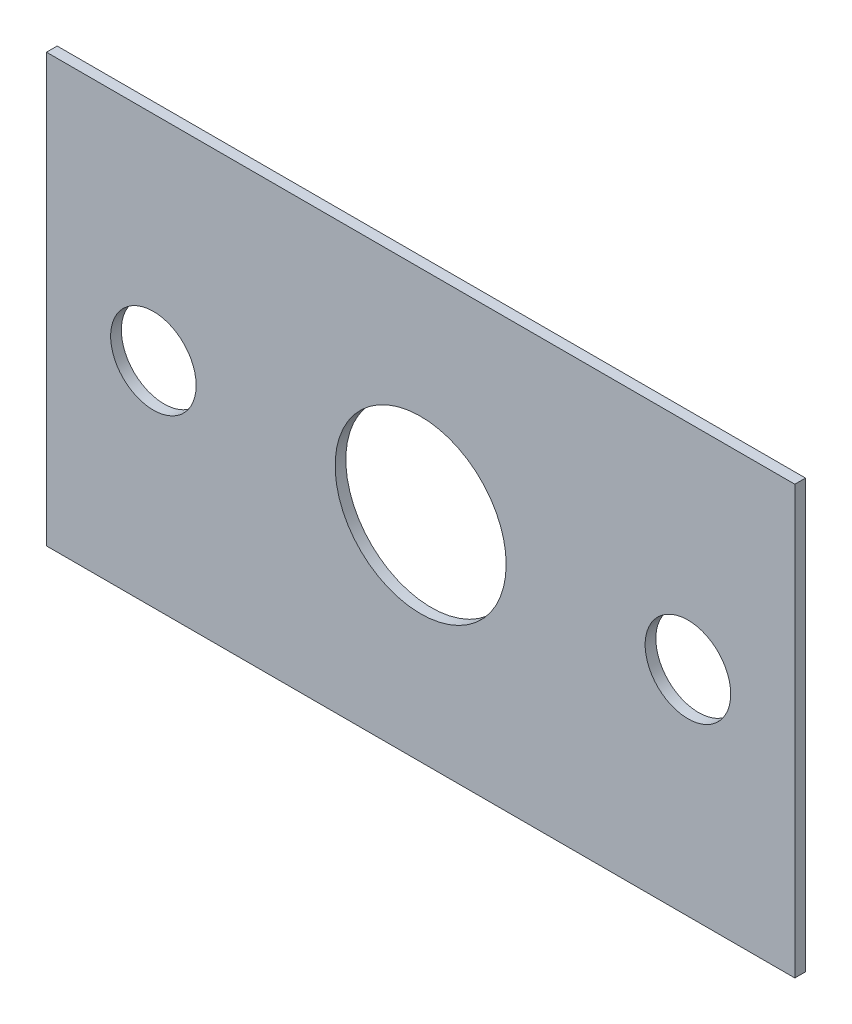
ISO-10303-21;
HEADER;
FILE_DESCRIPTION(('STEP AP214'),'2;1');
FILE_NAME('part.step','',(''),(''),'','','');
FILE_SCHEMA(('AUTOMOTIVE_DESIGN { 1 0 10303 214 1 1 1 1 }'));
ENDSEC;
DATA;
#1=APPLICATION_CONTEXT('core data for automotive mechanical design processes');
#2=APPLICATION_PROTOCOL_DEFINITION('international standard','automotive_design',2000,#1);
#3=PRODUCT_CONTEXT('',#1,'mechanical');
#4=PRODUCT('Part','Part','',(#3));
#5=PRODUCT_RELATED_PRODUCT_CATEGORY('part','',(#4));
#6=PRODUCT_DEFINITION_FORMATION('','',#4);
#7=PRODUCT_DEFINITION_CONTEXT('part definition',#1,'design');
#8=PRODUCT_DEFINITION('design','',#6,#7);
#9=PRODUCT_DEFINITION_SHAPE('','',#8);
#10=(LENGTH_UNIT() NAMED_UNIT(*) SI_UNIT(.MILLI.,.METRE.));
#11=(NAMED_UNIT(*) PLANE_ANGLE_UNIT() SI_UNIT($,.RADIAN.));
#12=(NAMED_UNIT(*) SI_UNIT($,.STERADIAN.) SOLID_ANGLE_UNIT());
#13=UNCERTAINTY_MEASURE_WITH_UNIT(LENGTH_MEASURE(1.E-05),#10,'distance_accuracy_value','');
#14=(GEOMETRIC_REPRESENTATION_CONTEXT(3) GLOBAL_UNCERTAINTY_ASSIGNED_CONTEXT((#13)) GLOBAL_UNIT_ASSIGNED_CONTEXT((#10,
#11,#12)) REPRESENTATION_CONTEXT('',''));
#15=CARTESIAN_POINT('',(0.,0.,0.));
#16=DIRECTION('',(0.,0.,1.));
#17=DIRECTION('',(1.,0.,0.));
#18=AXIS2_PLACEMENT_3D('',#15,#16,#17);
#19=CARTESIAN_POINT('',(-35.,-20.,1.));
#20=DIRECTION('',(0.,0.,1.));
#21=DIRECTION('',(1.,0.,0.));
#22=AXIS2_PLACEMENT_3D('',#19,#20,#21);
#23=PLANE('',#22);
#24=CARTESIAN_POINT('',(-25.,0.,1.));
#25=DIRECTION('',(0.,0.,1.));
#26=DIRECTION('',(1.,0.,0.));
#27=AXIS2_PLACEMENT_3D('',#24,#25,#26);
#28=CIRCLE('',#27,4.);
#29=CARTESIAN_POINT('',(-21.,0.,1.));
#30=VERTEX_POINT('',#29);
#31=EDGE_CURVE('E112',#30,#30,#28,.T.);
#32=ORIENTED_EDGE('',*,*,#31,.F.);
#33=EDGE_LOOP('',(#32));
#34=FACE_BOUND('',#33,.T.);
#35=DIRECTION('',(0.,-1.,0.));
#36=VECTOR('',#35,1.);
#37=CARTESIAN_POINT('',(-35.,20.,1.));
#38=LINE('',#37,#36);
#39=CARTESIAN_POINT('',(-35.,20.,1.));
#40=VERTEX_POINT('',#39);
#41=CARTESIAN_POINT('',(-35.,-20.,1.));
#42=VERTEX_POINT('',#41);
#43=EDGE_CURVE('E82',#40,#42,#38,.T.);
#44=ORIENTED_EDGE('',*,*,#43,.T.);
#45=DIRECTION('',(1.,0.,0.));
#46=VECTOR('',#45,1.);
#47=CARTESIAN_POINT('',(-35.,-20.,1.));
#48=LINE('',#47,#46);
#49=CARTESIAN_POINT('',(35.,-20.,1.));
#50=VERTEX_POINT('',#49);
#51=EDGE_CURVE('E77',#42,#50,#48,.T.);
#52=ORIENTED_EDGE('',*,*,#51,.T.);
#53=DIRECTION('',(0.,1.,0.));
#54=VECTOR('',#53,1.);
#55=CARTESIAN_POINT('',(35.,20.,1.));
#56=LINE('',#55,#54);
#57=CARTESIAN_POINT('',(35.,20.,1.));
#58=VERTEX_POINT('',#57);
#59=EDGE_CURVE('E80',#50,#58,#56,.T.);
#60=ORIENTED_EDGE('',*,*,#59,.T.);
#61=DIRECTION('',(-1.,0.,0.));
#62=VECTOR('',#61,1.);
#63=CARTESIAN_POINT('',(-35.,20.,1.));
#64=LINE('',#63,#62);
#65=EDGE_CURVE('E47',#58,#40,#64,.T.);
#66=ORIENTED_EDGE('',*,*,#65,.T.);
#67=EDGE_LOOP('',(#44,#52,#60,#66));
#68=FACE_BOUND('',#67,.T.);
#69=CARTESIAN_POINT('',(0.,0.,1.));
#70=DIRECTION('',(0.,0.,1.));
#71=DIRECTION('',(1.,0.,0.));
#72=AXIS2_PLACEMENT_3D('',#69,#70,#71);
#73=CIRCLE('',#72,8.);
#74=CARTESIAN_POINT('',(8.,0.,1.));
#75=VERTEX_POINT('',#74);
#76=EDGE_CURVE('E97',#75,#75,#73,.T.);
#77=ORIENTED_EDGE('',*,*,#76,.F.);
#78=EDGE_LOOP('',(#77));
#79=FACE_BOUND('',#78,.T.);
#80=CARTESIAN_POINT('',(25.,0.,1.));
#81=DIRECTION('',(0.,0.,1.));
#82=DIRECTION('',(1.,0.,0.));
#83=AXIS2_PLACEMENT_3D('',#80,#81,#82);
#84=CIRCLE('',#83,4.);
#85=CARTESIAN_POINT('',(29.,0.,1.));
#86=VERTEX_POINT('',#85);
#87=EDGE_CURVE('E118',#86,#86,#84,.T.);
#88=ORIENTED_EDGE('',*,*,#87,.F.);
#89=EDGE_LOOP('',(#88));
#90=FACE_BOUND('',#89,.T.);
#91=ADVANCED_FACE('F30',(#34,#68,#79,#90),#23,.T.);
#92=CARTESIAN_POINT('',(-35.,-20.,0.));
#93=DIRECTION('',(0.,0.,1.));
#94=DIRECTION('',(1.,0.,0.));
#95=AXIS2_PLACEMENT_3D('',#92,#93,#94);
#96=PLANE('',#95);
#97=CARTESIAN_POINT('',(-25.,0.,0.));
#98=DIRECTION('',(0.,0.,1.));
#99=DIRECTION('',(1.,0.,0.));
#100=AXIS2_PLACEMENT_3D('',#97,#98,#99);
#101=CIRCLE('',#100,4.);
#102=CARTESIAN_POINT('',(-21.,0.,0.));
#103=VERTEX_POINT('',#102);
#104=EDGE_CURVE('E115',#103,#103,#101,.T.);
#105=ORIENTED_EDGE('',*,*,#104,.T.);
#106=EDGE_LOOP('',(#105));
#107=FACE_BOUND('',#106,.T.);
#108=DIRECTION('',(0.,-1.,0.));
#109=VECTOR('',#108,1.);
#110=CARTESIAN_POINT('',(-35.,20.,0.));
#111=LINE('',#110,#109);
#112=CARTESIAN_POINT('',(-35.,20.,0.));
#113=VERTEX_POINT('',#112);
#114=CARTESIAN_POINT('',(-35.,-20.,0.));
#115=VERTEX_POINT('',#114);
#116=EDGE_CURVE('E94',#113,#115,#111,.T.);
#117=ORIENTED_EDGE('',*,*,#116,.F.);
#118=DIRECTION('',(-1.,0.,0.));
#119=VECTOR('',#118,1.);
#120=CARTESIAN_POINT('',(-35.,20.,0.));
#121=LINE('',#120,#119);
#122=CARTESIAN_POINT('',(35.,20.,0.));
#123=VERTEX_POINT('',#122);
#124=EDGE_CURVE('E70',#123,#113,#121,.T.);
#125=ORIENTED_EDGE('',*,*,#124,.F.);
#126=DIRECTION('',(0.,1.,0.));
#127=VECTOR('',#126,1.);
#128=CARTESIAN_POINT('',(35.,20.,0.));
#129=LINE('',#128,#127);
#130=CARTESIAN_POINT('',(35.,-20.,0.));
#131=VERTEX_POINT('',#130);
#132=EDGE_CURVE('E64',#131,#123,#129,.T.);
#133=ORIENTED_EDGE('',*,*,#132,.F.);
#134=DIRECTION('',(1.,0.,0.));
#135=VECTOR('',#134,1.);
#136=CARTESIAN_POINT('',(-35.,-20.,0.));
#137=LINE('',#136,#135);
#138=EDGE_CURVE('E86',#115,#131,#137,.T.);
#139=ORIENTED_EDGE('',*,*,#138,.F.);
#140=EDGE_LOOP('',(#117,#125,#133,#139));
#141=FACE_BOUND('',#140,.T.);
#142=CARTESIAN_POINT('',(0.,0.,0.));
#143=DIRECTION('',(0.,0.,1.));
#144=DIRECTION('',(1.,0.,0.));
#145=AXIS2_PLACEMENT_3D('',#142,#143,#144);
#146=CIRCLE('',#145,8.);
#147=CARTESIAN_POINT('',(8.,0.,0.));
#148=VERTEX_POINT('',#147);
#149=EDGE_CURVE('E109',#148,#148,#146,.T.);
#150=ORIENTED_EDGE('',*,*,#149,.T.);
#151=EDGE_LOOP('',(#150));
#152=FACE_BOUND('',#151,.T.);
#153=CARTESIAN_POINT('',(25.,0.,0.));
#154=DIRECTION('',(0.,0.,1.));
#155=DIRECTION('',(1.,0.,0.));
#156=AXIS2_PLACEMENT_3D('',#153,#154,#155);
#157=CIRCLE('',#156,4.);
#158=CARTESIAN_POINT('',(29.,0.,0.));
#159=VERTEX_POINT('',#158);
#160=EDGE_CURVE('E121',#159,#159,#157,.T.);
#161=ORIENTED_EDGE('',*,*,#160,.T.);
#162=EDGE_LOOP('',(#161));
#163=FACE_BOUND('',#162,.T.);
#164=ADVANCED_FACE('F105',(#107,#141,#152,#163),#96,.F.);
#165=CARTESIAN_POINT('',(-35.,20.,1.));
#166=DIRECTION('',(1.,0.,0.));
#167=DIRECTION('',(0.,1.,0.));
#168=AXIS2_PLACEMENT_3D('',#165,#166,#167);
#169=PLANE('',#168);
#170=ORIENTED_EDGE('',*,*,#116,.T.);
#171=DIRECTION('',(0.,0.,-1.));
#172=VECTOR('',#171,1.);
#173=CARTESIAN_POINT('',(-35.,-20.,1.));
#174=LINE('',#173,#172);
#175=EDGE_CURVE('E11',#42,#115,#174,.T.);
#176=ORIENTED_EDGE('',*,*,#175,.F.);
#177=ORIENTED_EDGE('',*,*,#43,.F.);
#178=DIRECTION('',(0.,0.,-1.));
#179=VECTOR('',#178,1.);
#180=CARTESIAN_POINT('',(-35.,20.,1.));
#181=LINE('',#180,#179);
#182=EDGE_CURVE('E90',#40,#113,#181,.T.);
#183=ORIENTED_EDGE('',*,*,#182,.T.);
#184=EDGE_LOOP('',(#170,#176,#177,#183));
#185=FACE_BOUND('',#184,.T.);
#186=ADVANCED_FACE('F32',(#185),#169,.F.);
#187=CARTESIAN_POINT('',(-35.,-20.,1.));
#188=DIRECTION('',(0.,1.,0.));
#189=DIRECTION('',(0.,0.,1.));
#190=AXIS2_PLACEMENT_3D('',#187,#188,#189);
#191=PLANE('',#190);
#192=ORIENTED_EDGE('',*,*,#138,.T.);
#193=DIRECTION('',(0.,0.,-1.));
#194=VECTOR('',#193,1.);
#195=CARTESIAN_POINT('',(35.,-20.,1.));
#196=LINE('',#195,#194);
#197=EDGE_CURVE('E39',#50,#131,#196,.T.);
#198=ORIENTED_EDGE('',*,*,#197,.F.);
#199=ORIENTED_EDGE('',*,*,#51,.F.);
#200=ORIENTED_EDGE('',*,*,#175,.T.);
#201=EDGE_LOOP('',(#192,#198,#199,#200));
#202=FACE_BOUND('',#201,.T.);
#203=ADVANCED_FACE('F85',(#202),#191,.F.);
#204=CARTESIAN_POINT('',(35.,20.,1.));
#205=DIRECTION('',(-1.,0.,0.));
#206=DIRECTION('',(0.,-1.,0.));
#207=AXIS2_PLACEMENT_3D('',#204,#205,#206);
#208=PLANE('',#207);
#209=ORIENTED_EDGE('',*,*,#132,.T.);
#210=DIRECTION('',(0.,0.,-1.));
#211=VECTOR('',#210,1.);
#212=CARTESIAN_POINT('',(35.,20.,1.));
#213=LINE('',#212,#211);
#214=EDGE_CURVE('E87',#58,#123,#213,.T.);
#215=ORIENTED_EDGE('',*,*,#214,.F.);
#216=ORIENTED_EDGE('',*,*,#59,.F.);
#217=ORIENTED_EDGE('',*,*,#197,.T.);
#218=EDGE_LOOP('',(#209,#215,#216,#217));
#219=FACE_BOUND('',#218,.T.);
#220=ADVANCED_FACE('F88',(#219),#208,.F.);
#221=CARTESIAN_POINT('',(-35.,20.,1.));
#222=DIRECTION('',(0.,-1.,0.));
#223=DIRECTION('',(0.,0.,-1.));
#224=AXIS2_PLACEMENT_3D('',#221,#222,#223);
#225=PLANE('',#224);
#226=ORIENTED_EDGE('',*,*,#124,.T.);
#227=ORIENTED_EDGE('',*,*,#182,.F.);
#228=ORIENTED_EDGE('',*,*,#65,.F.);
#229=ORIENTED_EDGE('',*,*,#214,.T.);
#230=EDGE_LOOP('',(#226,#227,#228,#229));
#231=FACE_BOUND('',#230,.T.);
#232=ADVANCED_FACE('F102',(#231),#225,.F.);
#233=CARTESIAN_POINT('',(0.,0.,1.));
#234=DIRECTION('',(0.,0.,-1.));
#235=DIRECTION('',(-1.,0.,0.));
#236=AXIS2_PLACEMENT_3D('',#233,#234,#235);
#237=CYLINDRICAL_SURFACE('',#236,8.);
#238=ORIENTED_EDGE('',*,*,#76,.T.);
#239=EDGE_LOOP('',(#238));
#240=FACE_BOUND('',#239,.T.);
#241=ORIENTED_EDGE('',*,*,#149,.F.);
#242=EDGE_LOOP('',(#241));
#243=FACE_BOUND('',#242,.T.);
#244=ADVANCED_FACE('F140',(#240,#243),#237,.F.);
#245=CARTESIAN_POINT('',(-25.,0.,1.));
#246=DIRECTION('',(0.,0.,-1.));
#247=DIRECTION('',(-1.,0.,0.));
#248=AXIS2_PLACEMENT_3D('',#245,#246,#247);
#249=CYLINDRICAL_SURFACE('',#248,4.);
#250=ORIENTED_EDGE('',*,*,#31,.T.);
#251=EDGE_LOOP('',(#250));
#252=FACE_BOUND('',#251,.T.);
#253=ORIENTED_EDGE('',*,*,#104,.F.);
#254=EDGE_LOOP('',(#253));
#255=FACE_BOUND('',#254,.T.);
#256=ADVANCED_FACE('F186',(#252,#255),#249,.F.);
#257=CARTESIAN_POINT('',(25.,0.,1.));
#258=DIRECTION('',(0.,0.,-1.));
#259=DIRECTION('',(-1.,0.,0.));
#260=AXIS2_PLACEMENT_3D('',#257,#258,#259);
#261=CYLINDRICAL_SURFACE('',#260,4.);
#262=ORIENTED_EDGE('',*,*,#87,.T.);
#263=EDGE_LOOP('',(#262));
#264=FACE_BOUND('',#263,.T.);
#265=ORIENTED_EDGE('',*,*,#160,.F.);
#266=EDGE_LOOP('',(#265));
#267=FACE_BOUND('',#266,.T.);
#268=ADVANCED_FACE('F127',(#264,#267),#261,.F.);
#269=CLOSED_SHELL('',(#91,#164,#186,#203,#220,#232,#244,#256,#268));
#270=MANIFOLD_SOLID_BREP('B2',#269);
#271=ADVANCED_BREP_SHAPE_REPRESENTATION('',(#18,#270),#14);
#272=SHAPE_DEFINITION_REPRESENTATION(#9,#271);
ENDSEC;
END-ISO-10303-21;
